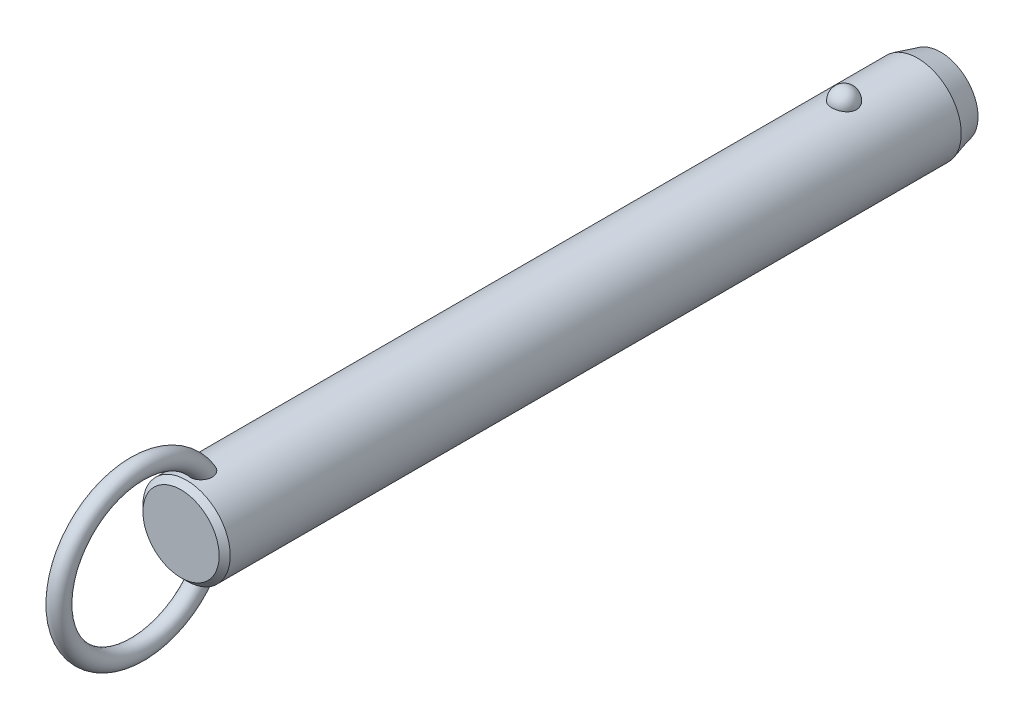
ISO-10303-21;
HEADER;
FILE_DESCRIPTION(('STEP AP214'),'2;1');
FILE_NAME('part.step','',(''),(''),'','','');
FILE_SCHEMA(('AUTOMOTIVE_DESIGN { 1 0 10303 214 1 1 1 1 }'));
ENDSEC;
DATA;
#1=APPLICATION_CONTEXT('core data for automotive mechanical design processes');
#2=APPLICATION_PROTOCOL_DEFINITION('international standard','automotive_design',2000,#1);
#3=PRODUCT_CONTEXT('',#1,'mechanical');
#4=PRODUCT('Part','Part','',(#3));
#5=PRODUCT_RELATED_PRODUCT_CATEGORY('part','',(#4));
#6=PRODUCT_DEFINITION_FORMATION('','',#4);
#7=PRODUCT_DEFINITION_CONTEXT('part definition',#1,'design');
#8=PRODUCT_DEFINITION('design','',#6,#7);
#9=PRODUCT_DEFINITION_SHAPE('','',#8);
#10=(LENGTH_UNIT() NAMED_UNIT(*) SI_UNIT(.MILLI.,.METRE.));
#11=(NAMED_UNIT(*) PLANE_ANGLE_UNIT() SI_UNIT($,.RADIAN.));
#12=(NAMED_UNIT(*) SI_UNIT($,.STERADIAN.) SOLID_ANGLE_UNIT());
#13=UNCERTAINTY_MEASURE_WITH_UNIT(LENGTH_MEASURE(1.E-05),#10,'distance_accuracy_value','');
#14=(GEOMETRIC_REPRESENTATION_CONTEXT(3) GLOBAL_UNCERTAINTY_ASSIGNED_CONTEXT((#13)) GLOBAL_UNIT_ASSIGNED_CONTEXT((#10,
#11,#12)) REPRESENTATION_CONTEXT('',''));
#15=CARTESIAN_POINT('',(0.,0.,0.));
#16=DIRECTION('',(0.,0.,1.));
#17=DIRECTION('',(1.,0.,0.));
#18=AXIS2_PLACEMENT_3D('',#15,#16,#17);
#19=CARTESIAN_POINT('',(0.,0.,132.1));
#20=DIRECTION('',(0.,0.,-1.));
#21=DIRECTION('',(-1.,0.,0.));
#22=AXIS2_PLACEMENT_3D('',#19,#20,#21);
#23=CYLINDRICAL_SURFACE('',#22,9.5);
#24=CARTESIAN_POINT('',(2.67259918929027,9.11631578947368,-2.70000000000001));
#25=CARTESIAN_POINT('',(2.6725968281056,9.11631786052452,-2.54909854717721));
#26=CARTESIAN_POINT('',(2.66030567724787,9.11994722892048,-2.39816735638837));
#27=CARTESIAN_POINT('',(2.6114347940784,9.13405924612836,-2.10058568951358));
#28=CARTESIAN_POINT('',(2.57484658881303,9.14454428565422,-1.95393672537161));
#29=CARTESIAN_POINT('',(2.47830875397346,9.17117631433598,-1.66916069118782));
#30=CARTESIAN_POINT('',(2.41836936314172,9.18732082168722,-1.53102991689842));
#31=CARTESIAN_POINT('',(2.27661331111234,9.22346780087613,-1.26705393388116));
#32=CARTESIAN_POINT('',(2.19479699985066,9.24347021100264,-1.14120852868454));
#33=CARTESIAN_POINT('',(2.01085282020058,9.28522401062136,-0.904632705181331));
#34=CARTESIAN_POINT('',(1.90862396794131,9.30698376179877,-0.793982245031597));
#35=CARTESIAN_POINT('',(1.6867437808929,9.34973971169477,-0.591607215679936));
#36=CARTESIAN_POINT('',(1.56709244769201,9.37073591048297,-0.499882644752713));
#37=CARTESIAN_POINT('',(1.31393976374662,9.40956370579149,-0.338167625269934));
#38=CARTESIAN_POINT('',(1.18048026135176,9.42740444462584,-0.268113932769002));
#39=CARTESIAN_POINT('',(0.903154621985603,9.45799906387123,-0.151390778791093));
#40=CARTESIAN_POINT('',(0.759289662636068,9.47075351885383,-0.104718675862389));
#41=CARTESIAN_POINT('',(0.468074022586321,9.48956256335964,-0.0367633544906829));
#42=CARTESIAN_POINT('',(0.320836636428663,9.49573643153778,-0.0150275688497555));
#43=CARTESIAN_POINT('',(0.0246714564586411,9.50112183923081,0.00396199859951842));
#44=CARTESIAN_POINT('',(-0.124256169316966,9.50033406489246,0.00121819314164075));
#45=CARTESIAN_POINT('',(-0.417264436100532,9.4919475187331,-0.0284441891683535));
#46=CARTESIAN_POINT('',(-0.56138413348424,9.48444885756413,-0.0550074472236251));
#47=CARTESIAN_POINT('',(-0.842986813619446,9.46357853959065,-0.131064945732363));
#48=CARTESIAN_POINT('',(-0.980469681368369,9.450206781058,-0.180559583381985));
#49=CARTESIAN_POINT('',(-1.24585005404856,9.41890822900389,-0.301476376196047));
#50=CARTESIAN_POINT('',(-1.37368611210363,9.40095498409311,-0.373026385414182));
#51=CARTESIAN_POINT('',(-1.61552738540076,9.36242964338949,-0.536025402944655));
#52=CARTESIAN_POINT('',(-1.72953116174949,9.34185727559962,-0.627476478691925));
#53=CARTESIAN_POINT('',(-1.9429225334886,9.29984568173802,-0.829844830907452));
#54=CARTESIAN_POINT('',(-2.04198021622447,9.27839736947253,-0.94110821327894));
#55=CARTESIAN_POINT('',(-2.22026460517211,9.23735994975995,-1.17883414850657));
#56=CARTESIAN_POINT('',(-2.29948985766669,9.21777097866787,-1.30529781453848));
#57=CARTESIAN_POINT('',(-2.43697287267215,9.18238994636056,-1.57158566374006));
#58=CARTESIAN_POINT('',(-2.49497068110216,9.16664569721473,-1.71155057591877));
#59=CARTESIAN_POINT('',(-2.5872073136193,9.14104303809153,-1.99961197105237));
#60=CARTESIAN_POINT('',(-2.62144683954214,9.13118445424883,-2.14770821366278));
#61=CARTESIAN_POINT('',(-2.66521466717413,9.11850622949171,-2.44715424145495));
#62=CARTESIAN_POINT('',(-2.67484831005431,9.11565658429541,-2.59848735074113));
#63=CARTESIAN_POINT('',(-2.66946735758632,9.11723375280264,-2.90067317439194));
#64=CARTESIAN_POINT('',(-2.65445345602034,9.12166036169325,-3.05152590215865));
#65=CARTESIAN_POINT('',(-2.60029711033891,9.13724422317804,-3.34766110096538));
#66=CARTESIAN_POINT('',(-2.56127978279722,9.14836656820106,-3.49296833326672));
#67=CARTESIAN_POINT('',(-2.46018844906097,9.17606676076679,-3.77477535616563));
#68=CARTESIAN_POINT('',(-2.39811349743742,9.1926448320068,-3.9112747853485));
#69=CARTESIAN_POINT('',(-2.25202303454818,9.22952198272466,-4.17244273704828));
#70=CARTESIAN_POINT('',(-2.16788714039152,9.24984129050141,-4.29704106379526));
#71=CARTESIAN_POINT('',(-1.9799408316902,9.29188255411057,-4.53013066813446));
#72=CARTESIAN_POINT('',(-1.87612963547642,9.31360456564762,-4.63862130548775));
#73=CARTESIAN_POINT('',(-1.65105429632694,9.35612959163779,-4.8369029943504));
#74=CARTESIAN_POINT('',(-1.52972405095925,9.37692871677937,-4.92661991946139));
#75=CARTESIAN_POINT('',(-1.27318250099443,9.41518970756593,-5.08429106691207));
#76=CARTESIAN_POINT('',(-1.13797219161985,9.432651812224,-5.15224684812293));
#77=CARTESIAN_POINT('',(-0.859280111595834,9.46208255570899,-5.26371827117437));
#78=CARTESIAN_POINT('',(-0.715925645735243,9.47411833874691,-5.30753421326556));
#79=CARTESIAN_POINT('',(-0.423550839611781,9.4916822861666,-5.37076321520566));
#80=CARTESIAN_POINT('',(-0.2745312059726,9.49721125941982,-5.39017930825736));
#81=CARTESIAN_POINT('',(0.0218446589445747,9.50110860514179,-5.40390587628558));
#82=CARTESIAN_POINT('',(0.16917707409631,9.49961381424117,-5.39869609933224));
#83=CARTESIAN_POINT('',(0.460808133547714,9.48993906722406,-5.36441955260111));
#84=CARTESIAN_POINT('',(0.605106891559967,9.48175936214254,-5.33535367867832));
#85=CARTESIAN_POINT('',(0.886027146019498,9.4596376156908,-5.25435587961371));
#86=CARTESIAN_POINT('',(1.02267710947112,9.44571881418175,-5.20251612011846));
#87=CARTESIAN_POINT('',(1.28523827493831,9.41358993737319,-5.07741549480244));
#88=CARTESIAN_POINT('',(1.41114877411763,9.39537958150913,-5.00415322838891));
#89=CARTESIAN_POINT('',(1.65085227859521,9.3562644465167,-4.83684599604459));
#90=CARTESIAN_POINT('',(1.76442346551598,9.33532178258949,-4.74249218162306));
#91=CARTESIAN_POINT('',(1.97425672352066,9.29321198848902,-4.53620389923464));
#92=CARTESIAN_POINT('',(2.07051582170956,9.27204482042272,-4.42426641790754));
#93=CARTESIAN_POINT('',(2.24490086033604,9.23139221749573,-4.18363183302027));
#94=CARTESIAN_POINT('',(2.32267019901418,9.21194380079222,-4.05466990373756));
#95=CARTESIAN_POINT('',(2.45584092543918,9.1773419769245,-3.78517836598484));
#96=CARTESIAN_POINT('',(2.5112497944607,9.16218713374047,-3.64465264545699));
#97=CARTESIAN_POINT('',(2.59380876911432,9.13913522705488,-3.37104301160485));
#98=CARTESIAN_POINT('',(2.62330266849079,9.13064624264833,-3.23871053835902));
#99=CARTESIAN_POINT('',(2.66269870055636,9.11923566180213,-2.97092664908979));
#100=CARTESIAN_POINT('',(2.67260130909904,9.11631393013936,-2.83547530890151));
#101=CARTESIAN_POINT('',(2.67259918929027,9.11631578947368,-2.70000000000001));
#102=B_SPLINE_CURVE_WITH_KNOTS('',3,(#24,#25,#26,#27,#28,#29,#30,#31,#32,#33,#34,#35,#36,#37,
#38,#39,#40,#41,#42,#43,#44,#45,#46,#47,#48,#49,#50,#51,#52,#53,#54,#55,#56,#57,#58,#59,#60,#61,
#62,#63,#64,#65,#66,#67,#68,#69,#70,#71,#72,#73,#74,#75,#76,#77,#78,#79,#80,#81,#82,#83,#84,#85,
#86,#87,#88,#89,#90,#91,#92,#93,#94,#95,#96,#97,#98,#99,#100,#101),.UNSPECIFIED.,.T.,.F.,(4,2,2,
2,2,2,2,2,2,2,2,2,2,2,2,2,2,2,2,2,2,2,2,2,2,2,2,2,2,2,2,2,2,2,2,2,2,2,4),(0.,0.452217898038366,
0.904593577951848,1.35677112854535,1.80894144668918,2.26340676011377,2.71787203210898,
3.17099820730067,3.62407318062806,4.0687883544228,4.51345969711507,4.95160616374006,
5.38976021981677,5.83050358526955,6.27129275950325,6.72071308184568,7.17016633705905,
7.62495278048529,8.07972578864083,8.53254856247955,8.98535859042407,9.43582813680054,
9.88631615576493,10.3393155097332,10.7923328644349,11.2471065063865,11.7018475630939,
12.150795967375,12.599688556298,13.0398725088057,13.4800399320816,13.9184421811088,
14.3568730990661,14.802202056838,15.2476074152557,15.7010097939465,16.1542603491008,
16.5602594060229,16.966248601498),.UNSPECIFIED.);
#103=CARTESIAN_POINT('',(2.67259918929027,9.11631578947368,-2.70000000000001));
#104=VERTEX_POINT('',#103);
#105=EDGE_CURVE('E41',#104,#104,#102,.T.);
#106=ORIENTED_EDGE('',*,*,#105,.T.);
#107=EDGE_LOOP('',(#106));
#108=FACE_BOUND('',#107,.T.);
#109=CARTESIAN_POINT('',(0.,0.,140.42));
#110=DIRECTION('',(0.,0.,1.));
#111=DIRECTION('',(1.,0.,0.));
#112=AXIS2_PLACEMENT_3D('',#109,#110,#111);
#113=CIRCLE('',#112,9.5);
#114=CARTESIAN_POINT('',(9.5,0.,140.42));
#115=VERTEX_POINT('',#114);
#116=EDGE_CURVE('E10',#115,#115,#113,.F.);
#117=ORIENTED_EDGE('',*,*,#116,.T.);
#118=EDGE_LOOP('',(#117));
#119=FACE_BOUND('',#118,.T.);
#120=CARTESIAN_POINT('',(-0.697062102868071,-9.47439269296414,134.767808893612));
#121=CARTESIAN_POINT('',(-0.799579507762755,-9.46685146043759,134.807482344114));
#122=CARTESIAN_POINT('',(-0.898575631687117,-9.45788043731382,134.8559309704));
#123=CARTESIAN_POINT('',(-1.08670047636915,-9.43811593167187,134.968868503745));
#124=CARTESIAN_POINT('',(-1.17583204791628,-9.42732297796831,135.033352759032));
#125=CARTESIAN_POINT('',(-1.34179806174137,-9.40513672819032,135.176209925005));
#126=CARTESIAN_POINT('',(-1.41865133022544,-9.39374438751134,135.254561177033));
#127=CARTESIAN_POINT('',(-1.55860047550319,-9.37154196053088,135.422752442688));
#128=CARTESIAN_POINT('',(-1.62169476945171,-9.3607319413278,135.51259377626));
#129=CARTESIAN_POINT('',(-1.73527695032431,-9.34035749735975,135.704500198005));
#130=CARTESIAN_POINT('',(-1.78522266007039,-9.33085270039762,135.806891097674));
#131=CARTESIAN_POINT('',(-1.86924997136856,-9.3143834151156,136.018148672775));
#132=CARTESIAN_POINT('',(-1.90332570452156,-9.30741986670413,136.127017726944));
#133=CARTESIAN_POINT('',(-1.95893603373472,-9.29588482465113,136.360473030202));
#134=CARTESIAN_POINT('',(-1.97872420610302,-9.29165182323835,136.485489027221));
#135=CARTESIAN_POINT('',(-2.00062129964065,-9.28695978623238,136.737080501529));
#136=CARTESIAN_POINT('',(-2.00272284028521,-9.28650232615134,136.863656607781));
#137=CARTESIAN_POINT('',(-1.98958876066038,-9.28932750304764,137.136815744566));
#138=CARTESIAN_POINT('',(-1.97143366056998,-9.2932400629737,137.283251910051));
#139=CARTESIAN_POINT('',(-1.91479925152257,-9.30507151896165,137.572062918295));
#140=CARTESIAN_POINT('',(-1.87629122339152,-9.31299607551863,137.714431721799));
#141=CARTESIAN_POINT('',(-1.77225683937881,-9.33340232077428,138.015172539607));
#142=CARTESIAN_POINT('',(-1.70334898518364,-9.34641636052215,138.172369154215));
#143=CARTESIAN_POINT('',(-1.58111062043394,-9.36759153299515,138.397517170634));
#144=CARTESIAN_POINT('',(-1.53721459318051,-9.37492619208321,138.470796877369));
#145=CARTESIAN_POINT('',(-1.4430263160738,-9.38988566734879,138.61307405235));
#146=CARTESIAN_POINT('',(-1.39273721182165,-9.39751033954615,138.682073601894));
#147=CARTESIAN_POINT('',(-1.26775962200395,-9.41530678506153,138.836983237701));
#148=CARTESIAN_POINT('',(-1.19052326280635,-9.42548108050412,138.920871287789));
#149=CARTESIAN_POINT('',(-1.02420241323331,-9.44499825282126,139.076008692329));
#150=CARTESIAN_POINT('',(-0.93513986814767,-9.45434261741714,139.147280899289));
#151=CARTESIAN_POINT('',(-0.766610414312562,-9.46930670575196,139.258695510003));
#152=CARTESIAN_POINT('',(-0.689439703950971,-9.47529223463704,139.302235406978));
#153=CARTESIAN_POINT('',(-0.528942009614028,-9.48560294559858,139.37631336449));
#154=CARTESIAN_POINT('',(-0.445620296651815,-9.48992953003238,139.406862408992));
#155=CARTESIAN_POINT('',(-0.273901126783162,-9.49644161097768,139.452579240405));
#156=CARTESIAN_POINT('',(-0.18546574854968,-9.49860811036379,139.46761059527));
#157=CARTESIAN_POINT('',(-0.00734541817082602,-9.5004135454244,139.480149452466));
#158=CARTESIAN_POINT('',(0.0823387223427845,-9.50005405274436,139.477667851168));
#159=CARTESIAN_POINT('',(0.24767927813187,-9.49708301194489,139.456995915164));
#160=CARTESIAN_POINT('',(0.323620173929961,-9.49477609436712,139.440930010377));
#161=CARTESIAN_POINT('',(0.471981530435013,-9.48855917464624,139.397172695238));
#162=CARTESIAN_POINT('',(0.544400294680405,-9.48464840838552,139.369475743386));
#163=CARTESIAN_POINT('',(0.708947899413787,-9.47398336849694,139.29280266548));
#164=CARTESIAN_POINT('',(0.799149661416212,-9.46671310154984,139.239774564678));
#165=CARTESIAN_POINT('',(0.969783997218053,-9.45076225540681,139.119973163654));
#166=CARTESIAN_POINT('',(1.050194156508,-9.44207854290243,139.053169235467));
#167=CARTESIAN_POINT('',(1.23092343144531,-9.42051459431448,138.880759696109));
#168=CARTESIAN_POINT('',(1.32652499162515,-9.40733378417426,138.77026193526));
#169=CARTESIAN_POINT('',(1.49893121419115,-9.38140745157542,138.535561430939));
#170=CARTESIAN_POINT('',(1.5757161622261,-9.36866239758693,138.411344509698));
#171=CARTESIAN_POINT('',(1.71285426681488,-9.34457644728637,138.149389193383));
#172=CARTESIAN_POINT('',(1.77266365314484,-9.33328726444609,138.01136233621));
#173=CARTESIAN_POINT('',(1.87239208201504,-9.31379209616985,137.728051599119));
#174=CARTESIAN_POINT('',(1.91230158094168,-9.3055875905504,137.582764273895));
#175=CARTESIAN_POINT('',(1.97604189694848,-9.29228394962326,137.262028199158));
#176=CARTESIAN_POINT('',(1.9958743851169,-9.28797202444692,137.085724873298));
#177=CARTESIAN_POINT('',(2.0029570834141,-9.28645519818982,136.732414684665));
#178=CARTESIAN_POINT('',(1.99025930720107,-9.28923895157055,136.555409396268));
#179=CARTESIAN_POINT('',(1.93735479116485,-9.30038134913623,136.256338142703));
#180=CARTESIAN_POINT('',(1.90576827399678,-9.30697680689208,136.132667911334));
#181=CARTESIAN_POINT('',(1.8228748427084,-9.32356855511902,135.892329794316));
#182=CARTESIAN_POINT('',(1.77158213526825,-9.33356239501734,135.775656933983));
#183=CARTESIAN_POINT('',(1.64885744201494,-9.35602275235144,135.552706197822));
#184=CARTESIAN_POINT('',(1.57730995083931,-9.36850332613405,135.446492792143));
#185=CARTESIAN_POINT('',(1.41543264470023,-9.39431873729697,135.249553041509));
#186=CARTESIAN_POINT('',(1.32510883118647,-9.40765330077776,135.158821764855));
#187=CARTESIAN_POINT('',(1.13846223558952,-9.43195720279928,135.005033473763));
#188=CARTESIAN_POINT('',(1.04369890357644,-9.44302894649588,134.940094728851));
#189=CARTESIAN_POINT('',(0.843965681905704,-9.46296805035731,134.828038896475));
#190=CARTESIAN_POINT('',(0.739000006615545,-9.47183631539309,134.780914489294));
#191=CARTESIAN_POINT('',(0.528175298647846,-9.48586140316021,134.708117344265));
#192=CARTESIAN_POINT('',(0.422686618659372,-9.49119633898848,134.68140249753));
#193=CARTESIAN_POINT('',(0.208590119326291,-9.49831365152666,134.646013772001));
#194=CARTESIAN_POINT('',(0.0999817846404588,-9.500095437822,134.637342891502));
#195=CARTESIAN_POINT('',(-0.126104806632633,-9.49988861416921,134.638350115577));
#196=CARTESIAN_POINT('',(-0.243578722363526,-9.49757821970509,134.649594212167));
#197=CARTESIAN_POINT('',(-0.474390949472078,-9.48885165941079,134.693167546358));
#198=CARTESIAN_POINT('',(-0.587729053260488,-9.48243528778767,134.725497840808));
#199=CARTESIAN_POINT('',(-0.697062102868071,-9.47439269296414,134.767808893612));
#200=B_SPLINE_CURVE_WITH_KNOTS('',3,(#120,#121,#122,#123,#124,#125,#126,#127,#128,#129,#130,
#131,#132,#133,#134,#135,#136,#137,#138,#139,#140,#141,#142,#143,#144,#145,#146,#147,#148,#149,
#150,#151,#152,#153,#154,#155,#156,#157,#158,#159,#160,#161,#162,#163,#164,#165,#166,#167,#168,
#169,#170,#171,#172,#173,#174,#175,#176,#177,#178,#179,#180,#181,#182,#183,#184,#185,#186,#187,
#188,#189,#190,#191,#192,#193,#194,#195,#196,#197,#198,#199),.UNSPECIFIED.,.T.,.F.,(4,2,2,2,2,2,
2,2,2,2,2,2,2,2,2,2,2,2,2,2,2,2,2,2,2,2,2,2,2,2,2,2,2,2,2,2,2,2,2,4),(0.,0.330119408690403,
0.660143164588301,0.989655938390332,1.31920659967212,1.66074728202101,2.00241415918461,
2.38088696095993,2.75951768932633,3.20065679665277,3.64242004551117,4.15620996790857,
4.4131416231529,4.66994734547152,5.01228664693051,5.35399933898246,5.61943037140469,
5.88463652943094,6.15215502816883,6.4195070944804,6.65144391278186,6.88349136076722,
7.19641200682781,7.51003602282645,7.94779711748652,8.3860149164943,8.83699707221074,
9.28819530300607,9.81778662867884,10.34653170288,10.7284172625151,11.1100280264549,
11.4938603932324,11.8775702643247,12.2220189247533,12.5663259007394,12.8915939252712,
13.2169159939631,13.5689650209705,13.9210316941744),.UNSPECIFIED.);
#201=CARTESIAN_POINT('',(-0.697062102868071,-9.47439269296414,134.767808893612));
#202=VERTEX_POINT('',#201);
#203=EDGE_CURVE('E60',#202,#202,#200,.T.);
#204=ORIENTED_EDGE('',*,*,#203,.T.);
#205=EDGE_LOOP('',(#204));
#206=FACE_BOUND('',#205,.T.);
#207=CARTESIAN_POINT('',(-0.697062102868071,9.47439269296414,134.767808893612));
#208=CARTESIAN_POINT('',(-0.597792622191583,9.48169483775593,134.72939564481));
#209=CARTESIAN_POINT('',(-0.495106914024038,9.48766580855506,134.699168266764));
#210=CARTESIAN_POINT('',(-0.285876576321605,9.49627648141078,134.656032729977));
#211=CARTESIAN_POINT('',(-0.179324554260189,9.49890941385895,134.643159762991));
#212=CARTESIAN_POINT('',(0.0344157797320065,9.50053798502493,134.635166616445));
#213=CARTESIAN_POINT('',(0.141603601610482,9.49953613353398,134.640034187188));
#214=CARTESIAN_POINT('',(0.35356357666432,9.49401038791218,134.667365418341));
#215=CARTESIAN_POINT('',(0.458336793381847,9.48948807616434,134.68982117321));
#216=CARTESIAN_POINT('',(0.662493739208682,9.4774236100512,134.751671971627));
#217=CARTESIAN_POINT('',(0.761881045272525,9.46988348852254,134.791055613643));
#218=CARTESIAN_POINT('',(0.952608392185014,9.45260382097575,134.885634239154));
#219=CARTESIAN_POINT('',(1.04394806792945,9.44286417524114,134.940829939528));
#220=CARTESIAN_POINT('',(1.21712767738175,9.42211760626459,135.066066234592));
#221=CARTESIAN_POINT('',(1.29885671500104,9.41109835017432,135.136257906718));
#222=CARTESIAN_POINT('',(1.44978975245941,9.38903310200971,135.288980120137));
#223=CARTESIAN_POINT('',(1.51899278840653,9.37798710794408,135.371511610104));
#224=CARTESIAN_POINT('',(1.64602857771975,9.35654375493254,135.549776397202));
#225=CARTESIAN_POINT('',(1.70333052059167,9.34618688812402,135.645891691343));
#226=CARTESIAN_POINT('',(1.80259341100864,9.32755128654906,135.845897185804));
#227=CARTESIAN_POINT('',(1.84454942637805,9.31927322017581,135.949789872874));
#228=CARTESIAN_POINT('',(1.91637039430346,9.30478365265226,136.172213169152));
#229=CARTESIAN_POINT('',(1.944805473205,9.29882552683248,136.291219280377));
#230=CARTESIAN_POINT('',(1.98449865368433,9.29043398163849,136.532143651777));
#231=CARTESIAN_POINT('',(1.99574908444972,9.28800213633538,136.654063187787));
#232=CARTESIAN_POINT('',(2.00275141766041,9.28649645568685,136.916932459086));
#233=CARTESIAN_POINT('',(1.99588238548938,9.28799035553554,137.057952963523));
#234=CARTESIAN_POINT('',(1.96270559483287,9.29505517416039,137.337621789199));
#235=CARTESIAN_POINT('',(1.93637872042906,9.30063010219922,137.476267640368));
#236=CARTESIAN_POINT('',(1.85949176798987,9.31633564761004,137.772561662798));
#237=CARTESIAN_POINT('',(1.80549792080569,9.3270926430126,137.929290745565));
#238=CARTESIAN_POINT('',(1.67376869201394,9.3516306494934,138.232284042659));
#239=CARTESIAN_POINT('',(1.59603181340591,9.36541185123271,138.378547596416));
#240=CARTESIAN_POINT('',(1.4360277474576,9.39110706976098,138.625813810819));
#241=CARTESIAN_POINT('',(1.35831795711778,9.40278656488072,138.729791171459));
#242=CARTESIAN_POINT('',(1.18774483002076,9.42585025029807,138.924534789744));
#243=CARTESIAN_POINT('',(1.09490932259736,9.43723493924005,139.015324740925));
#244=CARTESIAN_POINT('',(0.92111037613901,9.45552616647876,139.15620334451));
#245=CARTESIAN_POINT('',(0.84373824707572,9.46281058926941,139.210656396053));
#246=CARTESIAN_POINT('',(0.681245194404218,9.47589120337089,139.306711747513));
#247=CARTESIAN_POINT('',(0.596135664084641,9.48168953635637,139.348332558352));
#248=CARTESIAN_POINT('',(0.433779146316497,9.49038144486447,139.410089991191));
#249=CARTESIAN_POINT('',(0.357459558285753,9.49359170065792,139.43260136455));
#250=CARTESIAN_POINT('',(0.202074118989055,9.49816761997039,139.464574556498));
#251=CARTESIAN_POINT('',(0.123010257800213,9.49953459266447,139.474045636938));
#252=CARTESIAN_POINT('',(-0.0357372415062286,9.50026497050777,139.479114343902));
#253=CARTESIAN_POINT('',(-0.115421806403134,9.49962433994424,139.474684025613));
#254=CARTESIAN_POINT('',(-0.272823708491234,9.49640854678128,139.452296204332));
#255=CARTESIAN_POINT('',(-0.350540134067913,9.4938325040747,139.434332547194));
#256=CARTESIAN_POINT('',(-0.500580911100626,9.48709462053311,139.386802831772));
#257=CARTESIAN_POINT('',(-0.572979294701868,9.48296359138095,139.357461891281));
#258=CARTESIAN_POINT('',(-0.712864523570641,9.47347609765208,139.289008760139));
#259=CARTESIAN_POINT('',(-0.780349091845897,9.46811906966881,139.249892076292));
#260=CARTESIAN_POINT('',(-0.946309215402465,9.45329720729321,139.139432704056));
#261=CARTESIAN_POINT('',(-1.04090230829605,9.44321512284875,139.062329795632));
#262=CARTESIAN_POINT('',(-1.21661929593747,9.42219227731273,138.89409718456));
#263=CARTESIAN_POINT('',(-1.29770519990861,9.41124921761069,138.802929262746));
#264=CARTESIAN_POINT('',(-1.47319646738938,9.38563439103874,138.576162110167));
#265=CARTESIAN_POINT('',(-1.56208878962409,9.37102009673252,138.436289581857));
#266=CARTESIAN_POINT('',(-1.71623987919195,9.34401559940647,138.143950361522));
#267=CARTESIAN_POINT('',(-1.78147866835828,9.33162728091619,137.991473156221));
#268=CARTESIAN_POINT('',(-1.88853837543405,9.31055541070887,137.675647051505));
#269=CARTESIAN_POINT('',(-1.92998995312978,9.30193076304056,137.512168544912));
#270=CARTESIAN_POINT('',(-1.98590726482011,9.29015757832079,137.180526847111));
#271=CARTESIAN_POINT('',(-2.0004070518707,9.2870021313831,137.012369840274));
#272=CARTESIAN_POINT('',(-1.99964701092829,9.28716218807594,136.705080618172));
#273=CARTESIAN_POINT('',(-1.98908145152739,9.28945704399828,136.565936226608));
#274=CARTESIAN_POINT('',(-1.94566294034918,9.29865169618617,136.291153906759));
#275=CARTESIAN_POINT('',(-1.9128206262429,9.30554929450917,136.155514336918));
#276=CARTESIAN_POINT('',(-1.84582133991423,9.31898248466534,135.957802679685));
#277=CARTESIAN_POINT('',(-1.82038084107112,9.32400364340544,135.892583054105));
#278=CARTESIAN_POINT('',(-1.76350511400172,9.33492884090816,135.764903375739));
#279=CARTESIAN_POINT('',(-1.73207305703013,9.34083241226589,135.702441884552));
#280=CARTESIAN_POINT('',(-1.66324243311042,9.35333332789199,135.58094078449));
#281=CARTESIAN_POINT('',(-1.62584239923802,9.35993084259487,135.521902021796));
#282=CARTESIAN_POINT('',(-1.54527678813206,9.37356864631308,135.407987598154));
#283=CARTESIAN_POINT('',(-1.50211241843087,9.38060884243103,135.353111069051));
#284=CARTESIAN_POINT('',(-1.37681147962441,9.40004442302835,135.209961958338));
#285=CARTESIAN_POINT('',(-1.28916358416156,9.41261047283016,135.126429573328));
#286=CARTESIAN_POINT('',(-1.09996826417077,9.43658180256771,134.977236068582));
#287=CARTESIAN_POINT('',(-0.998461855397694,9.44799034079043,134.911523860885));
#288=CARTESIAN_POINT('',(-0.860188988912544,9.46103017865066,134.8394367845));
#289=CARTESIAN_POINT('',(-0.828141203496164,9.46389141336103,134.823851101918));
#290=CARTESIAN_POINT('',(-0.763210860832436,9.46934915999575,134.794473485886));
#291=CARTESIAN_POINT('',(-0.730328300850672,9.47194567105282,134.780681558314));
#292=CARTESIAN_POINT('',(-0.697062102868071,9.47439269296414,134.767808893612));
#293=B_SPLINE_CURVE_WITH_KNOTS('',3,(#207,#208,#209,#210,#211,#212,#213,#214,#215,#216,#217,
#218,#219,#220,#221,#222,#223,#224,#225,#226,#227,#228,#229,#230,#231,#232,#233,#234,#235,#236,
#237,#238,#239,#240,#241,#242,#243,#244,#245,#246,#247,#248,#249,#250,#251,#252,#253,#254,#255,
#256,#257,#258,#259,#260,#261,#262,#263,#264,#265,#266,#267,#268,#269,#270,#271,#272,#273,#274,
#275,#276,#277,#278,#279,#280,#281,#282,#283,#284,#285,#286,#287,#288,#289,#290,#291,#292),
.UNSPECIFIED.,.T.,.F.,(4,2,2,2,2,2,2,2,2,2,2,2,2,2,2,2,2,2,2,2,2,2,2,2,2,2,2,2,2,2,2,2,2,2,2,2,
2,2,2,2,2,2,4),(0.,0.319942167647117,0.640532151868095,0.96090081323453,1.2811255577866,
1.60113495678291,1.92115886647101,2.24457323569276,2.56801248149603,2.90371927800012,
3.23953387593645,3.60560313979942,3.97183576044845,4.39383693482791,4.8162532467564,
5.31257045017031,5.80891895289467,6.19868344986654,6.58773876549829,6.87145417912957,
7.15475838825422,7.39263751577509,7.63034760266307,7.86853584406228,8.10683246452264,
8.3406366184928,8.57454843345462,8.93983939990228,9.30614105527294,9.80266668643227,
10.2996107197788,10.8040753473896,11.3079021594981,11.7249776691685,12.1418541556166,
12.3521485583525,12.5623319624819,12.7725671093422,12.9827582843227,13.345827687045,
13.7078449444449,13.8150604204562,13.9222762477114),.UNSPECIFIED.);
#294=CARTESIAN_POINT('',(-0.697062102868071,9.47439269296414,134.767808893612));
#295=VERTEX_POINT('',#294);
#296=EDGE_CURVE('E68',#295,#295,#293,.T.);
#297=ORIENTED_EDGE('',*,*,#296,.T.);
#298=EDGE_LOOP('',(#297));
#299=FACE_BOUND('',#298,.T.);
#300=CARTESIAN_POINT('',(0.,0.,-18.6999999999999));
#301=DIRECTION('',(0.,0.,-1.));
#302=DIRECTION('',(-1.,0.,0.));
#303=AXIS2_PLACEMENT_3D('',#300,#301,#302);
#304=CIRCLE('',#303,9.5);
#305=CARTESIAN_POINT('',(-9.5,0.,-18.6999999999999));
#306=VERTEX_POINT('',#305);
#307=EDGE_CURVE('E57',#306,#306,#304,.F.);
#308=ORIENTED_EDGE('',*,*,#307,.T.);
#309=EDGE_LOOP('',(#308));
#310=FACE_BOUND('',#309,.T.);
#311=ADVANCED_FACE('F37',(#108,#119,#206,#299,#310),#23,.T.);
#312=CARTESIAN_POINT('',(0.,0.,-23.7));
#313=DIRECTION('',(0.,0.,-1.));
#314=DIRECTION('',(-1.,0.,0.));
#315=AXIS2_PLACEMENT_3D('',#312,#313,#314);
#316=PLANE('',#315);
#317=CARTESIAN_POINT('',(0.,0.,-23.7));
#318=DIRECTION('',(0.,0.,-1.));
#319=DIRECTION('',(-1.,0.,0.));
#320=AXIS2_PLACEMENT_3D('',#317,#318,#319);
#321=CIRCLE('',#320,8.16025403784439);
#322=CARTESIAN_POINT('',(-8.16025403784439,0.,-23.7));
#323=VERTEX_POINT('',#322);
#324=EDGE_CURVE('E67',#323,#323,#321,.T.);
#325=ORIENTED_EDGE('',*,*,#324,.T.);
#326=EDGE_LOOP('',(#325));
#327=FACE_BOUND('',#326,.T.);
#328=ADVANCED_FACE('F86',(#327),#316,.T.);
#329=CARTESIAN_POINT('',(0.,0.,-23.7));
#330=DIRECTION('',(0.,0.,1.));
#331=DIRECTION('',(1.,0.,0.));
#332=AXIS2_PLACEMENT_3D('',#329,#330,#331);
#333=CONICAL_SURFACE('',#332,8.16025403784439,0.261799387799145);
#334=ORIENTED_EDGE('',*,*,#307,.F.);
#335=EDGE_LOOP('',(#334));
#336=FACE_BOUND('',#335,.T.);
#337=ORIENTED_EDGE('',*,*,#324,.F.);
#338=EDGE_LOOP('',(#337));
#339=FACE_BOUND('',#338,.T.);
#340=ADVANCED_FACE('F84',(#336,#339),#333,.T.);
#341=CARTESIAN_POINT('',(0.,0.,141.62));
#342=DIRECTION('',(0.,0.,1.));
#343=DIRECTION('',(1.,0.,0.));
#344=AXIS2_PLACEMENT_3D('',#341,#342,#343);
#345=PLANE('',#344);
#346=CARTESIAN_POINT('',(0.,0.,141.62));
#347=DIRECTION('',(0.,0.,1.));
#348=DIRECTION('',(1.,0.,0.));
#349=AXIS2_PLACEMENT_3D('',#346,#347,#348);
#350=CIRCLE('',#349,8.30000000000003);
#351=CARTESIAN_POINT('',(8.30000000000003,0.,141.62));
#352=VERTEX_POINT('',#351);
#353=EDGE_CURVE('E50',#352,#352,#350,.T.);
#354=ORIENTED_EDGE('',*,*,#353,.T.);
#355=EDGE_LOOP('',(#354));
#356=FACE_BOUND('',#355,.T.);
#357=ADVANCED_FACE('F78',(#356),#345,.T.);
#358=CARTESIAN_POINT('',(0.,0.,151.15));
#359=DIRECTION('',(1.,0.,0.));
#360=DIRECTION('',(0.,0.,-1.));
#361=AXIS2_PLACEMENT_3D('',#358,#359,#360);
#362=TOROIDAL_SURFACE('',#361,17.05,2.);
#363=ORIENTED_EDGE('',*,*,#296,.F.);
#364=EDGE_LOOP('',(#363));
#365=FACE_BOUND('',#364,.T.);
#366=ORIENTED_EDGE('',*,*,#203,.F.);
#367=EDGE_LOOP('',(#366));
#368=FACE_BOUND('',#367,.T.);
#369=ADVANCED_FACE('F74',(#365,#368),#362,.T.);
#370=CARTESIAN_POINT('',(0.,0.,141.62));
#371=DIRECTION('',(0.,0.,-1.));
#372=DIRECTION('',(-1.,0.,0.));
#373=AXIS2_PLACEMENT_3D('',#370,#371,#372);
#374=CONICAL_SURFACE('',#373,8.30000000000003,0.785398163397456);
#375=ORIENTED_EDGE('',*,*,#116,.F.);
#376=EDGE_LOOP('',(#375));
#377=FACE_BOUND('',#376,.T.);
#378=ORIENTED_EDGE('',*,*,#353,.F.);
#379=EDGE_LOOP('',(#378));
#380=FACE_BOUND('',#379,.T.);
#381=ADVANCED_FACE('F39',(#377,#380),#374,.T.);
#382=CARTESIAN_POINT('',(0.,9.5,-2.70000000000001));
#383=DIRECTION('',(0.,1.,0.));
#384=DIRECTION('',(0.,0.,-1.));
#385=AXIS2_PLACEMENT_3D('',#382,#383,#384);
#386=SPHERICAL_SURFACE('',#385,2.7);
#387=ORIENTED_EDGE('',*,*,#105,.F.);
#388=EDGE_LOOP('',(#387));
#389=FACE_BOUND('',#388,.T.);
#390=ADVANCED_FACE('F80',(#389),#386,.T.);
#391=CLOSED_SHELL('',(#311,#328,#340,#357,#369,#381,#390));
#392=MANIFOLD_SOLID_BREP('B2',#391);
#393=ADVANCED_BREP_SHAPE_REPRESENTATION('',(#18,#392),#14);
#394=SHAPE_DEFINITION_REPRESENTATION(#9,#393);
ENDSEC;
END-ISO-10303-21;
